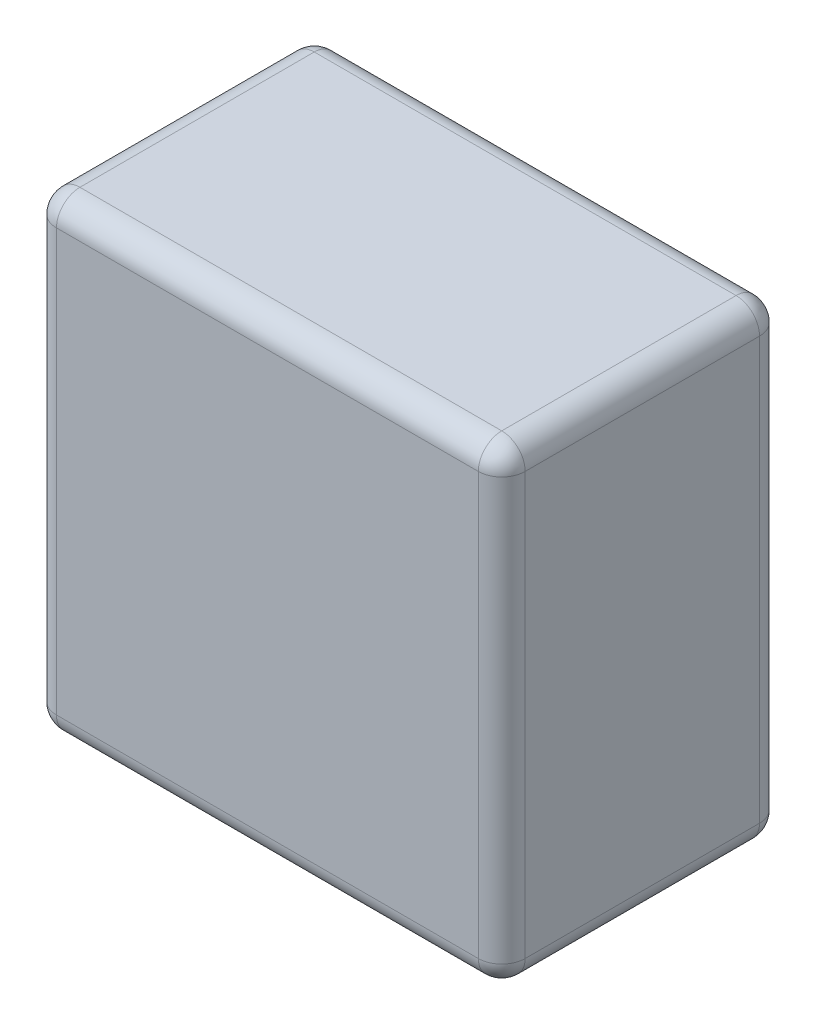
ISO-10303-21;
HEADER;
FILE_DESCRIPTION(('STEP AP214'),'2;1');
FILE_NAME('part.step','',(''),(''),'','','');
FILE_SCHEMA(('AUTOMOTIVE_DESIGN { 1 0 10303 214 1 1 1 1 }'));
ENDSEC;
DATA;
#1=APPLICATION_CONTEXT('core data for automotive mechanical design processes');
#2=APPLICATION_PROTOCOL_DEFINITION('international standard','automotive_design',2000,#1);
#3=PRODUCT_CONTEXT('',#1,'mechanical');
#4=PRODUCT('Part','Part','',(#3));
#5=PRODUCT_RELATED_PRODUCT_CATEGORY('part','',(#4));
#6=PRODUCT_DEFINITION_FORMATION('','',#4);
#7=PRODUCT_DEFINITION_CONTEXT('part definition',#1,'design');
#8=PRODUCT_DEFINITION('design','',#6,#7);
#9=PRODUCT_DEFINITION_SHAPE('','',#8);
#10=(LENGTH_UNIT() NAMED_UNIT(*) SI_UNIT(.MILLI.,.METRE.));
#11=(NAMED_UNIT(*) PLANE_ANGLE_UNIT() SI_UNIT($,.RADIAN.));
#12=(NAMED_UNIT(*) SI_UNIT($,.STERADIAN.) SOLID_ANGLE_UNIT());
#13=UNCERTAINTY_MEASURE_WITH_UNIT(LENGTH_MEASURE(1.E-05),#10,'distance_accuracy_value','');
#14=(GEOMETRIC_REPRESENTATION_CONTEXT(3) GLOBAL_UNCERTAINTY_ASSIGNED_CONTEXT((#13)) GLOBAL_UNIT_ASSIGNED_CONTEXT((#10,
#11,#12)) REPRESENTATION_CONTEXT('',''));
#15=CARTESIAN_POINT('',(0.,0.,0.));
#16=DIRECTION('',(0.,0.,1.));
#17=DIRECTION('',(1.,0.,0.));
#18=AXIS2_PLACEMENT_3D('',#15,#16,#17);
#19=CARTESIAN_POINT('',(30.,10.,12.));
#20=DIRECTION('',(1.,0.,0.));
#21=DIRECTION('',(0.,1.,0.));
#22=AXIS2_PLACEMENT_3D('',#19,#20,#21);
#23=PLANE('',#22);
#24=DIRECTION('',(0.,-1.,0.));
#25=VECTOR('',#24,1.);
#26=CARTESIAN_POINT('',(30.,10.,1.));
#27=LINE('',#26,#25);
#28=CARTESIAN_POINT('',(30.,9.,1.));
#29=VERTEX_POINT('',#28);
#30=CARTESIAN_POINT('',(30.,-9.,1.));
#31=VERTEX_POINT('',#30);
#32=EDGE_CURVE('E193',#29,#31,#27,.T.);
#33=ORIENTED_EDGE('',*,*,#32,.T.);
#34=DIRECTION('',(0.,0.,-1.));
#35=VECTOR('',#34,1.);
#36=CARTESIAN_POINT('',(30.,-9.,12.));
#37=LINE('',#36,#35);
#38=CARTESIAN_POINT('',(30.,-9.,11.));
#39=VERTEX_POINT('',#38);
#40=EDGE_CURVE('E196',#31,#39,#37,.F.);
#41=ORIENTED_EDGE('',*,*,#40,.T.);
#42=DIRECTION('',(0.,-1.,0.));
#43=VECTOR('',#42,1.);
#44=CARTESIAN_POINT('',(30.,10.,11.));
#45=LINE('',#44,#43);
#46=CARTESIAN_POINT('',(30.,9.,11.));
#47=VERTEX_POINT('',#46);
#48=EDGE_CURVE('E191',#39,#47,#45,.F.);
#49=ORIENTED_EDGE('',*,*,#48,.T.);
#50=DIRECTION('',(0.,0.,-1.));
#51=VECTOR('',#50,1.);
#52=CARTESIAN_POINT('',(30.,9.,0.));
#53=LINE('',#52,#51);
#54=EDGE_CURVE('E189',#47,#29,#53,.T.);
#55=ORIENTED_EDGE('',*,*,#54,.T.);
#56=EDGE_LOOP('',(#33,#41,#49,#55));
#57=FACE_BOUND('',#56,.T.);
#58=ADVANCED_FACE('F34',(#57),#23,.F.);
#59=CARTESIAN_POINT('',(30.,-10.,12.));
#60=DIRECTION('',(0.,1.,0.));
#61=DIRECTION('',(0.,0.,1.));
#62=AXIS2_PLACEMENT_3D('',#59,#60,#61);
#63=PLANE('',#62);
#64=DIRECTION('',(1.,0.,0.));
#65=VECTOR('',#64,1.);
#66=CARTESIAN_POINT('',(30.,-10.,1.));
#67=LINE('',#66,#65);
#68=CARTESIAN_POINT('',(31.,-10.,1.));
#69=VERTEX_POINT('',#68);
#70=CARTESIAN_POINT('',(49.,-10.,1.));
#71=VERTEX_POINT('',#70);
#72=EDGE_CURVE('E133',#69,#71,#67,.T.);
#73=ORIENTED_EDGE('',*,*,#72,.T.);
#74=DIRECTION('',(0.,0.,-1.));
#75=VECTOR('',#74,1.);
#76=CARTESIAN_POINT('',(49.,-10.,12.));
#77=LINE('',#76,#75);
#78=CARTESIAN_POINT('',(49.,-10.,11.));
#79=VERTEX_POINT('',#78);
#80=EDGE_CURVE('E129',#71,#79,#77,.F.);
#81=ORIENTED_EDGE('',*,*,#80,.T.);
#82=DIRECTION('',(1.,0.,0.));
#83=VECTOR('',#82,1.);
#84=CARTESIAN_POINT('',(30.,-10.,11.));
#85=LINE('',#84,#83);
#86=CARTESIAN_POINT('',(31.,-10.,11.));
#87=VERTEX_POINT('',#86);
#88=EDGE_CURVE('E121',#79,#87,#85,.F.);
#89=ORIENTED_EDGE('',*,*,#88,.T.);
#90=DIRECTION('',(0.,0.,-1.));
#91=VECTOR('',#90,1.);
#92=CARTESIAN_POINT('',(31.,-10.,12.));
#93=LINE('',#92,#91);
#94=EDGE_CURVE('E126',#87,#69,#93,.T.);
#95=ORIENTED_EDGE('',*,*,#94,.T.);
#96=EDGE_LOOP('',(#73,#81,#89,#95));
#97=FACE_BOUND('',#96,.T.);
#98=ADVANCED_FACE('F124',(#97),#63,.F.);
#99=CARTESIAN_POINT('',(50.,10.,12.));
#100=DIRECTION('',(1.,0.,0.));
#101=DIRECTION('',(0.,0.,-1.));
#102=AXIS2_PLACEMENT_3D('',#99,#100,#101);
#103=PLANE('',#102);
#104=DIRECTION('',(0.,-1.,0.));
#105=VECTOR('',#104,1.);
#106=CARTESIAN_POINT('',(50.,10.,11.));
#107=LINE('',#106,#105);
#108=CARTESIAN_POINT('',(50.,9.,11.));
#109=VERTEX_POINT('',#108);
#110=CARTESIAN_POINT('',(50.,-9.,11.));
#111=VERTEX_POINT('',#110);
#112=EDGE_CURVE('E173',#109,#111,#107,.T.);
#113=ORIENTED_EDGE('',*,*,#112,.T.);
#114=DIRECTION('',(0.,0.,-1.));
#115=VECTOR('',#114,1.);
#116=CARTESIAN_POINT('',(50.,-9.,0.));
#117=LINE('',#116,#115);
#118=CARTESIAN_POINT('',(50.,-9.,1.));
#119=VERTEX_POINT('',#118);
#120=EDGE_CURVE('E178',#111,#119,#117,.T.);
#121=ORIENTED_EDGE('',*,*,#120,.T.);
#122=DIRECTION('',(0.,-1.,0.));
#123=VECTOR('',#122,1.);
#124=CARTESIAN_POINT('',(50.,10.,1.));
#125=LINE('',#124,#123);
#126=CARTESIAN_POINT('',(50.,9.,1.));
#127=VERTEX_POINT('',#126);
#128=EDGE_CURVE('E175',#119,#127,#125,.F.);
#129=ORIENTED_EDGE('',*,*,#128,.T.);
#130=DIRECTION('',(0.,0.,-1.));
#131=VECTOR('',#130,1.);
#132=CARTESIAN_POINT('',(50.,9.,12.));
#133=LINE('',#132,#131);
#134=EDGE_CURVE('E171',#127,#109,#133,.F.);
#135=ORIENTED_EDGE('',*,*,#134,.T.);
#136=EDGE_LOOP('',(#113,#121,#129,#135));
#137=FACE_BOUND('',#136,.T.);
#138=ADVANCED_FACE('F264',(#137),#103,.T.);
#139=CARTESIAN_POINT('',(30.,10.,12.));
#140=DIRECTION('',(0.,1.,0.));
#141=DIRECTION('',(-1.,0.,0.));
#142=AXIS2_PLACEMENT_3D('',#139,#140,#141);
#143=PLANE('',#142);
#144=DIRECTION('',(1.,0.,0.));
#145=VECTOR('',#144,1.);
#146=CARTESIAN_POINT('',(30.,10.,11.));
#147=LINE('',#146,#145);
#148=CARTESIAN_POINT('',(31.,10.,11.));
#149=VERTEX_POINT('',#148);
#150=CARTESIAN_POINT('',(49.,10.,11.));
#151=VERTEX_POINT('',#150);
#152=EDGE_CURVE('E182',#149,#151,#147,.T.);
#153=ORIENTED_EDGE('',*,*,#152,.T.);
#154=DIRECTION('',(0.,0.,-1.));
#155=VECTOR('',#154,1.);
#156=CARTESIAN_POINT('',(49.,10.,12.));
#157=LINE('',#156,#155);
#158=CARTESIAN_POINT('',(49.,10.,1.));
#159=VERTEX_POINT('',#158);
#160=EDGE_CURVE('E187',#151,#159,#157,.T.);
#161=ORIENTED_EDGE('',*,*,#160,.T.);
#162=DIRECTION('',(1.,0.,0.));
#163=VECTOR('',#162,1.);
#164=CARTESIAN_POINT('',(30.,10.,1.));
#165=LINE('',#164,#163);
#166=CARTESIAN_POINT('',(31.,10.,1.));
#167=VERTEX_POINT('',#166);
#168=EDGE_CURVE('E184',#159,#167,#165,.F.);
#169=ORIENTED_EDGE('',*,*,#168,.T.);
#170=DIRECTION('',(0.,0.,-1.));
#171=VECTOR('',#170,1.);
#172=CARTESIAN_POINT('',(31.,10.,12.));
#173=LINE('',#172,#171);
#174=EDGE_CURVE('E180',#167,#149,#173,.F.);
#175=ORIENTED_EDGE('',*,*,#174,.T.);
#176=EDGE_LOOP('',(#153,#161,#169,#175));
#177=FACE_BOUND('',#176,.T.);
#178=ADVANCED_FACE('F273',(#177),#143,.T.);
#179=CARTESIAN_POINT('',(0.,0.,12.));
#180=DIRECTION('',(0.,0.,1.));
#181=DIRECTION('',(1.,0.,0.));
#182=AXIS2_PLACEMENT_3D('',#179,#180,#181);
#183=PLANE('',#182);
#184=DIRECTION('',(0.,-1.,0.));
#185=VECTOR('',#184,1.);
#186=CARTESIAN_POINT('',(49.,0.,12.));
#187=LINE('',#186,#185);
#188=CARTESIAN_POINT('',(49.,-9.,12.));
#189=VERTEX_POINT('',#188);
#190=CARTESIAN_POINT('',(49.,9.,12.));
#191=VERTEX_POINT('',#190);
#192=EDGE_CURVE('E43',#189,#191,#187,.F.);
#193=ORIENTED_EDGE('',*,*,#192,.T.);
#194=DIRECTION('',(1.,0.,0.));
#195=VECTOR('',#194,1.);
#196=CARTESIAN_POINT('',(0.,9.00000000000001,12.));
#197=LINE('',#196,#195);
#198=CARTESIAN_POINT('',(31.,9.,12.));
#199=VERTEX_POINT('',#198);
#200=EDGE_CURVE('E11',#191,#199,#197,.F.);
#201=ORIENTED_EDGE('',*,*,#200,.T.);
#202=DIRECTION('',(0.,-1.,0.));
#203=VECTOR('',#202,1.);
#204=CARTESIAN_POINT('',(31.,-10.,12.));
#205=LINE('',#204,#203);
#206=CARTESIAN_POINT('',(31.,-9.,12.));
#207=VERTEX_POINT('',#206);
#208=EDGE_CURVE('E198',#199,#207,#205,.T.);
#209=ORIENTED_EDGE('',*,*,#208,.T.);
#210=DIRECTION('',(1.,0.,0.));
#211=VECTOR('',#210,1.);
#212=CARTESIAN_POINT('',(50.,-9.,12.));
#213=LINE('',#212,#211);
#214=EDGE_CURVE('E54',#207,#189,#213,.T.);
#215=ORIENTED_EDGE('',*,*,#214,.T.);
#216=EDGE_LOOP('',(#193,#201,#209,#215));
#217=FACE_BOUND('',#216,.T.);
#218=ADVANCED_FACE('F295',(#217),#183,.T.);
#219=CARTESIAN_POINT('',(0.,0.,0.));
#220=DIRECTION('',(0.,0.,1.));
#221=DIRECTION('',(1.,0.,0.));
#222=AXIS2_PLACEMENT_3D('',#219,#220,#221);
#223=PLANE('',#222);
#224=DIRECTION('',(0.,-1.,0.));
#225=VECTOR('',#224,1.);
#226=CARTESIAN_POINT('',(49.,-10.,0.));
#227=LINE('',#226,#225);
#228=CARTESIAN_POINT('',(49.,9.,0.));
#229=VERTEX_POINT('',#228);
#230=CARTESIAN_POINT('',(49.,-9.,0.));
#231=VERTEX_POINT('',#230);
#232=EDGE_CURVE('E166',#229,#231,#227,.T.);
#233=ORIENTED_EDGE('',*,*,#232,.T.);
#234=DIRECTION('',(1.,0.,0.));
#235=VECTOR('',#234,1.);
#236=CARTESIAN_POINT('',(0.,-9.,0.));
#237=LINE('',#236,#235);
#238=CARTESIAN_POINT('',(31.,-9.,0.));
#239=VERTEX_POINT('',#238);
#240=EDGE_CURVE('E168',#231,#239,#237,.F.);
#241=ORIENTED_EDGE('',*,*,#240,.T.);
#242=DIRECTION('',(0.,-1.,0.));
#243=VECTOR('',#242,1.);
#244=CARTESIAN_POINT('',(31.,0.,0.));
#245=LINE('',#244,#243);
#246=CARTESIAN_POINT('',(31.,9.,0.));
#247=VERTEX_POINT('',#246);
#248=EDGE_CURVE('E162',#239,#247,#245,.F.);
#249=ORIENTED_EDGE('',*,*,#248,.T.);
#250=DIRECTION('',(1.,0.,0.));
#251=VECTOR('',#250,1.);
#252=CARTESIAN_POINT('',(50.,9.,0.));
#253=LINE('',#252,#251);
#254=EDGE_CURVE('E164',#247,#229,#253,.T.);
#255=ORIENTED_EDGE('',*,*,#254,.T.);
#256=EDGE_LOOP('',(#233,#241,#249,#255));
#257=FACE_BOUND('',#256,.T.);
#258=ADVANCED_FACE('F297',(#257),#223,.F.);
#259=CARTESIAN_POINT('',(30.,9.,11.));
#260=DIRECTION('',(1.,0.,0.));
#261=DIRECTION('',(0.,1.,0.));
#262=AXIS2_PLACEMENT_3D('',#259,#260,#261);
#263=CYLINDRICAL_SURFACE('',#262,1.);
#264=CARTESIAN_POINT('',(31.,9.,11.));
#265=DIRECTION('',(-1.,0.,0.));
#266=DIRECTION('',(0.,0.,1.));
#267=AXIS2_PLACEMENT_3D('',#264,#265,#266);
#268=CIRCLE('',#267,1.);
#269=EDGE_CURVE('E38',#199,#149,#268,.T.);
#270=ORIENTED_EDGE('',*,*,#269,.F.);
#271=ORIENTED_EDGE('',*,*,#200,.F.);
#272=CARTESIAN_POINT('',(49.,9.,11.));
#273=DIRECTION('',(1.,0.,0.));
#274=DIRECTION('',(0.,0.,-1.));
#275=AXIS2_PLACEMENT_3D('',#272,#273,#274);
#276=CIRCLE('',#275,1.);
#277=EDGE_CURVE('E158',#151,#191,#276,.T.);
#278=ORIENTED_EDGE('',*,*,#277,.F.);
#279=ORIENTED_EDGE('',*,*,#152,.F.);
#280=EDGE_LOOP('',(#270,#271,#278,#279));
#281=FACE_BOUND('',#280,.T.);
#282=ADVANCED_FACE('F36',(#281),#263,.T.);
#283=CARTESIAN_POINT('',(31.,9.,11.));
#284=DIRECTION('',(0.,0.,1.));
#285=DIRECTION('',(1.,0.,0.));
#286=AXIS2_PLACEMENT_3D('',#283,#284,#285);
#287=SPHERICAL_SURFACE('',#286,1.);
#288=CARTESIAN_POINT('',(31.,9.,11.));
#289=DIRECTION('',(0.,1.,0.));
#290=DIRECTION('',(0.,0.,1.));
#291=AXIS2_PLACEMENT_3D('',#288,#289,#290);
#292=CIRCLE('',#291,1.);
#293=EDGE_CURVE('E244',#199,#47,#292,.F.);
#294=ORIENTED_EDGE('',*,*,#293,.F.);
#295=ORIENTED_EDGE('',*,*,#269,.T.);
#296=CARTESIAN_POINT('',(31.,9.,11.));
#297=DIRECTION('',(0.,0.,1.));
#298=DIRECTION('',(1.,0.,0.));
#299=AXIS2_PLACEMENT_3D('',#296,#297,#298);
#300=CIRCLE('',#299,1.);
#301=EDGE_CURVE('E247',#47,#149,#300,.F.);
#302=ORIENTED_EDGE('',*,*,#301,.F.);
#303=EDGE_LOOP('',(#294,#295,#302));
#304=FACE_BOUND('',#303,.T.);
#305=ADVANCED_FACE('F291',(#304),#287,.T.);
#306=CARTESIAN_POINT('',(49.,9.,11.));
#307=DIRECTION('',(0.,0.,1.));
#308=DIRECTION('',(1.,0.,0.));
#309=AXIS2_PLACEMENT_3D('',#306,#307,#308);
#310=SPHERICAL_SURFACE('',#309,1.);
#311=CARTESIAN_POINT('',(49.,9.,11.));
#312=DIRECTION('',(0.,0.,1.));
#313=DIRECTION('',(1.,0.,0.));
#314=AXIS2_PLACEMENT_3D('',#311,#312,#313);
#315=CIRCLE('',#314,1.);
#316=EDGE_CURVE('E238',#151,#109,#315,.F.);
#317=ORIENTED_EDGE('',*,*,#316,.F.);
#318=ORIENTED_EDGE('',*,*,#277,.T.);
#319=CARTESIAN_POINT('',(49.,9.,11.));
#320=DIRECTION('',(0.,1.,0.));
#321=DIRECTION('',(0.,0.,1.));
#322=AXIS2_PLACEMENT_3D('',#319,#320,#321);
#323=CIRCLE('',#322,1.);
#324=EDGE_CURVE('E241',#109,#191,#323,.F.);
#325=ORIENTED_EDGE('',*,*,#324,.F.);
#326=EDGE_LOOP('',(#317,#318,#325));
#327=FACE_BOUND('',#326,.T.);
#328=ADVANCED_FACE('F254',(#327),#310,.T.);
#329=CARTESIAN_POINT('',(31.,9.,12.));
#330=DIRECTION('',(0.,0.,1.));
#331=DIRECTION('',(1.,0.,0.));
#332=AXIS2_PLACEMENT_3D('',#329,#330,#331);
#333=CYLINDRICAL_SURFACE('',#332,1.);
#334=ORIENTED_EDGE('',*,*,#301,.T.);
#335=ORIENTED_EDGE('',*,*,#174,.F.);
#336=CARTESIAN_POINT('',(31.,9.,1.));
#337=DIRECTION('',(0.,0.,-1.));
#338=DIRECTION('',(0.,1.,0.));
#339=AXIS2_PLACEMENT_3D('',#336,#337,#338);
#340=CIRCLE('',#339,1.);
#341=EDGE_CURVE('E233',#29,#167,#340,.T.);
#342=ORIENTED_EDGE('',*,*,#341,.F.);
#343=ORIENTED_EDGE('',*,*,#54,.F.);
#344=EDGE_LOOP('',(#334,#335,#342,#343));
#345=FACE_BOUND('',#344,.T.);
#346=ADVANCED_FACE('F285',(#345),#333,.T.);
#347=CARTESIAN_POINT('',(31.,0.,11.));
#348=DIRECTION('',(0.,1.,0.));
#349=DIRECTION('',(-1.,0.,0.));
#350=AXIS2_PLACEMENT_3D('',#347,#348,#349);
#351=CYLINDRICAL_SURFACE('',#350,1.);
#352=ORIENTED_EDGE('',*,*,#293,.T.);
#353=ORIENTED_EDGE('',*,*,#48,.F.);
#354=CARTESIAN_POINT('',(31.,-9.,11.));
#355=DIRECTION('',(0.,-1.,0.));
#356=DIRECTION('',(0.,0.,-1.));
#357=AXIS2_PLACEMENT_3D('',#354,#355,#356);
#358=CIRCLE('',#357,1.);
#359=EDGE_CURVE('E142',#207,#39,#358,.T.);
#360=ORIENTED_EDGE('',*,*,#359,.F.);
#361=ORIENTED_EDGE('',*,*,#208,.F.);
#362=EDGE_LOOP('',(#352,#353,#360,#361));
#363=FACE_BOUND('',#362,.T.);
#364=ADVANCED_FACE('F294',(#363),#351,.T.);
#365=CARTESIAN_POINT('',(0.,-9.,11.));
#366=DIRECTION('',(-1.,0.,0.));
#367=DIRECTION('',(0.,0.,1.));
#368=AXIS2_PLACEMENT_3D('',#365,#366,#367);
#369=CYLINDRICAL_SURFACE('',#368,1.);
#370=CARTESIAN_POINT('',(49.,-9.,11.));
#371=DIRECTION('',(1.,0.,0.));
#372=DIRECTION('',(0.,0.,-1.));
#373=AXIS2_PLACEMENT_3D('',#370,#371,#372);
#374=CIRCLE('',#373,1.);
#375=EDGE_CURVE('E143',#189,#79,#374,.T.);
#376=ORIENTED_EDGE('',*,*,#375,.F.);
#377=ORIENTED_EDGE('',*,*,#214,.F.);
#378=CARTESIAN_POINT('',(31.,-9.,11.));
#379=DIRECTION('',(-1.,0.,0.));
#380=DIRECTION('',(0.,0.,1.));
#381=AXIS2_PLACEMENT_3D('',#378,#379,#380);
#382=CIRCLE('',#381,1.);
#383=EDGE_CURVE('E136',#87,#207,#382,.T.);
#384=ORIENTED_EDGE('',*,*,#383,.F.);
#385=ORIENTED_EDGE('',*,*,#88,.F.);
#386=EDGE_LOOP('',(#376,#377,#384,#385));
#387=FACE_BOUND('',#386,.T.);
#388=ADVANCED_FACE('F138',(#387),#369,.T.);
#389=CARTESIAN_POINT('',(49.,10.,11.));
#390=DIRECTION('',(0.,-1.,0.));
#391=DIRECTION('',(0.,0.,-1.));
#392=AXIS2_PLACEMENT_3D('',#389,#390,#391);
#393=CYLINDRICAL_SURFACE('',#392,1.);
#394=ORIENTED_EDGE('',*,*,#324,.T.);
#395=ORIENTED_EDGE('',*,*,#192,.F.);
#396=CARTESIAN_POINT('',(49.,-9.,11.));
#397=DIRECTION('',(0.,-1.,0.));
#398=DIRECTION('',(0.,0.,-1.));
#399=AXIS2_PLACEMENT_3D('',#396,#397,#398);
#400=CIRCLE('',#399,1.);
#401=EDGE_CURVE('E228',#111,#189,#400,.T.);
#402=ORIENTED_EDGE('',*,*,#401,.F.);
#403=ORIENTED_EDGE('',*,*,#112,.F.);
#404=EDGE_LOOP('',(#394,#395,#402,#403));
#405=FACE_BOUND('',#404,.T.);
#406=ADVANCED_FACE('F260',(#405),#393,.T.);
#407=CARTESIAN_POINT('',(49.,9.,12.));
#408=DIRECTION('',(0.,0.,-1.));
#409=DIRECTION('',(-1.,0.,0.));
#410=AXIS2_PLACEMENT_3D('',#407,#408,#409);
#411=CYLINDRICAL_SURFACE('',#410,1.);
#412=ORIENTED_EDGE('',*,*,#316,.T.);
#413=ORIENTED_EDGE('',*,*,#134,.F.);
#414=CARTESIAN_POINT('',(49.,9.,1.));
#415=DIRECTION('',(0.,0.,-1.));
#416=DIRECTION('',(-1.,0.,0.));
#417=AXIS2_PLACEMENT_3D('',#414,#415,#416);
#418=CIRCLE('',#417,1.);
#419=EDGE_CURVE('E225',#159,#127,#418,.T.);
#420=ORIENTED_EDGE('',*,*,#419,.F.);
#421=ORIENTED_EDGE('',*,*,#160,.F.);
#422=EDGE_LOOP('',(#412,#413,#420,#421));
#423=FACE_BOUND('',#422,.T.);
#424=ADVANCED_FACE('F270',(#423),#411,.T.);
#425=CARTESIAN_POINT('',(0.,9.00000000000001,1.));
#426=DIRECTION('',(-1.,0.,0.));
#427=DIRECTION('',(0.,-1.,0.));
#428=AXIS2_PLACEMENT_3D('',#425,#426,#427);
#429=CYLINDRICAL_SURFACE('',#428,1.);
#430=CARTESIAN_POINT('',(31.,9.,1.));
#431=DIRECTION('',(-1.,0.,0.));
#432=DIRECTION('',(0.,0.,1.));
#433=AXIS2_PLACEMENT_3D('',#430,#431,#432);
#434=CIRCLE('',#433,1.);
#435=EDGE_CURVE('E235',#167,#247,#434,.T.);
#436=ORIENTED_EDGE('',*,*,#435,.F.);
#437=ORIENTED_EDGE('',*,*,#168,.F.);
#438=CARTESIAN_POINT('',(49.,9.,1.));
#439=DIRECTION('',(1.,0.,0.));
#440=DIRECTION('',(0.,0.,-1.));
#441=AXIS2_PLACEMENT_3D('',#438,#439,#440);
#442=CIRCLE('',#441,1.);
#443=EDGE_CURVE('E222',#229,#159,#442,.T.);
#444=ORIENTED_EDGE('',*,*,#443,.F.);
#445=ORIENTED_EDGE('',*,*,#254,.F.);
#446=EDGE_LOOP('',(#436,#437,#444,#445));
#447=FACE_BOUND('',#446,.T.);
#448=ADVANCED_FACE('F277',(#447),#429,.T.);
#449=CARTESIAN_POINT('',(31.,9.,1.));
#450=DIRECTION('',(0.,0.,1.));
#451=DIRECTION('',(1.,0.,0.));
#452=AXIS2_PLACEMENT_3D('',#449,#450,#451);
#453=SPHERICAL_SURFACE('',#452,1.);
#454=ORIENTED_EDGE('',*,*,#341,.T.);
#455=ORIENTED_EDGE('',*,*,#435,.T.);
#456=CARTESIAN_POINT('',(31.,9.,1.));
#457=DIRECTION('',(0.,1.,0.));
#458=DIRECTION('',(-1.,0.,0.));
#459=AXIS2_PLACEMENT_3D('',#456,#457,#458);
#460=CIRCLE('',#459,1.);
#461=EDGE_CURVE('E150',#29,#247,#460,.F.);
#462=ORIENTED_EDGE('',*,*,#461,.F.);
#463=EDGE_LOOP('',(#454,#455,#462));
#464=FACE_BOUND('',#463,.T.);
#465=ADVANCED_FACE('F351',(#464),#453,.T.);
#466=CARTESIAN_POINT('',(31.,-9.,11.));
#467=DIRECTION('',(0.,0.,1.));
#468=DIRECTION('',(1.,0.,0.));
#469=AXIS2_PLACEMENT_3D('',#466,#467,#468);
#470=SPHERICAL_SURFACE('',#469,1.);
#471=ORIENTED_EDGE('',*,*,#383,.T.);
#472=ORIENTED_EDGE('',*,*,#359,.T.);
#473=CARTESIAN_POINT('',(31.,-9.,11.));
#474=DIRECTION('',(0.,0.,1.));
#475=DIRECTION('',(1.,0.,0.));
#476=AXIS2_PLACEMENT_3D('',#473,#474,#475);
#477=CIRCLE('',#476,1.);
#478=EDGE_CURVE('E146',#87,#39,#477,.F.);
#479=ORIENTED_EDGE('',*,*,#478,.F.);
#480=EDGE_LOOP('',(#471,#472,#479));
#481=FACE_BOUND('',#480,.T.);
#482=ADVANCED_FACE('F147',(#481),#470,.T.);
#483=CARTESIAN_POINT('',(49.,-9.,11.));
#484=DIRECTION('',(0.,0.,1.));
#485=DIRECTION('',(1.,0.,0.));
#486=AXIS2_PLACEMENT_3D('',#483,#484,#485);
#487=SPHERICAL_SURFACE('',#486,1.);
#488=ORIENTED_EDGE('',*,*,#401,.T.);
#489=ORIENTED_EDGE('',*,*,#375,.T.);
#490=CARTESIAN_POINT('',(49.,-9.,11.));
#491=DIRECTION('',(0.,0.,1.));
#492=DIRECTION('',(1.,0.,0.));
#493=AXIS2_PLACEMENT_3D('',#490,#491,#492);
#494=CIRCLE('',#493,1.);
#495=EDGE_CURVE('E151',#111,#79,#494,.F.);
#496=ORIENTED_EDGE('',*,*,#495,.F.);
#497=EDGE_LOOP('',(#488,#489,#496));
#498=FACE_BOUND('',#497,.T.);
#499=ADVANCED_FACE('F344',(#498),#487,.T.);
#500=CARTESIAN_POINT('',(49.,9.,1.));
#501=DIRECTION('',(0.,0.,1.));
#502=DIRECTION('',(1.,0.,0.));
#503=AXIS2_PLACEMENT_3D('',#500,#501,#502);
#504=SPHERICAL_SURFACE('',#503,1.);
#505=ORIENTED_EDGE('',*,*,#443,.T.);
#506=ORIENTED_EDGE('',*,*,#419,.T.);
#507=CARTESIAN_POINT('',(49.,9.,1.));
#508=DIRECTION('',(0.,1.,0.));
#509=DIRECTION('',(0.,0.,1.));
#510=AXIS2_PLACEMENT_3D('',#507,#508,#509);
#511=CIRCLE('',#510,1.);
#512=EDGE_CURVE('E216',#229,#127,#511,.F.);
#513=ORIENTED_EDGE('',*,*,#512,.F.);
#514=EDGE_LOOP('',(#505,#506,#513));
#515=FACE_BOUND('',#514,.T.);
#516=ADVANCED_FACE('F340',(#515),#504,.T.);
#517=CARTESIAN_POINT('',(31.,10.,1.));
#518=DIRECTION('',(0.,-1.,0.));
#519=DIRECTION('',(1.,0.,0.));
#520=AXIS2_PLACEMENT_3D('',#517,#518,#519);
#521=CYLINDRICAL_SURFACE('',#520,1.);
#522=ORIENTED_EDGE('',*,*,#461,.T.);
#523=ORIENTED_EDGE('',*,*,#248,.F.);
#524=CARTESIAN_POINT('',(31.,-9.,1.));
#525=DIRECTION('',(0.,-1.,0.));
#526=DIRECTION('',(0.,0.,-1.));
#527=AXIS2_PLACEMENT_3D('',#524,#525,#526);
#528=CIRCLE('',#527,1.);
#529=EDGE_CURVE('E213',#31,#239,#528,.T.);
#530=ORIENTED_EDGE('',*,*,#529,.F.);
#531=ORIENTED_EDGE('',*,*,#32,.F.);
#532=EDGE_LOOP('',(#522,#523,#530,#531));
#533=FACE_BOUND('',#532,.T.);
#534=ADVANCED_FACE('F337',(#533),#521,.T.);
#535=CARTESIAN_POINT('',(31.,-9.,12.));
#536=DIRECTION('',(0.,0.,-1.));
#537=DIRECTION('',(-1.,0.,0.));
#538=AXIS2_PLACEMENT_3D('',#535,#536,#537);
#539=CYLINDRICAL_SURFACE('',#538,1.);
#540=ORIENTED_EDGE('',*,*,#478,.T.);
#541=ORIENTED_EDGE('',*,*,#40,.F.);
#542=CARTESIAN_POINT('',(31.,-9.,1.));
#543=DIRECTION('',(0.,0.,-1.));
#544=DIRECTION('',(-1.,0.,0.));
#545=AXIS2_PLACEMENT_3D('',#542,#543,#544);
#546=CIRCLE('',#545,1.);
#547=EDGE_CURVE('E154',#69,#31,#546,.T.);
#548=ORIENTED_EDGE('',*,*,#547,.F.);
#549=ORIENTED_EDGE('',*,*,#94,.F.);
#550=EDGE_LOOP('',(#540,#541,#548,#549));
#551=FACE_BOUND('',#550,.T.);
#552=ADVANCED_FACE('F153',(#551),#539,.T.);
#553=CARTESIAN_POINT('',(49.,-9.,12.));
#554=DIRECTION('',(0.,0.,1.));
#555=DIRECTION('',(1.,0.,0.));
#556=AXIS2_PLACEMENT_3D('',#553,#554,#555);
#557=CYLINDRICAL_SURFACE('',#556,1.);
#558=ORIENTED_EDGE('',*,*,#495,.T.);
#559=ORIENTED_EDGE('',*,*,#80,.F.);
#560=CARTESIAN_POINT('',(49.,-9.,1.));
#561=DIRECTION('',(0.,0.,-1.));
#562=DIRECTION('',(0.,1.,0.));
#563=AXIS2_PLACEMENT_3D('',#560,#561,#562);
#564=CIRCLE('',#563,1.);
#565=EDGE_CURVE('E209',#119,#71,#564,.T.);
#566=ORIENTED_EDGE('',*,*,#565,.F.);
#567=ORIENTED_EDGE('',*,*,#120,.F.);
#568=EDGE_LOOP('',(#558,#559,#566,#567));
#569=FACE_BOUND('',#568,.T.);
#570=ADVANCED_FACE('F330',(#569),#557,.T.);
#571=CARTESIAN_POINT('',(49.,0.,1.));
#572=DIRECTION('',(0.,1.,0.));
#573=DIRECTION('',(0.,0.,1.));
#574=AXIS2_PLACEMENT_3D('',#571,#572,#573);
#575=CYLINDRICAL_SURFACE('',#574,1.);
#576=ORIENTED_EDGE('',*,*,#512,.T.);
#577=ORIENTED_EDGE('',*,*,#128,.F.);
#578=CARTESIAN_POINT('',(49.,-9.,1.));
#579=DIRECTION('',(0.,-1.,0.));
#580=DIRECTION('',(1.,0.,0.));
#581=AXIS2_PLACEMENT_3D('',#578,#579,#580);
#582=CIRCLE('',#581,1.);
#583=EDGE_CURVE('E206',#231,#119,#582,.T.);
#584=ORIENTED_EDGE('',*,*,#583,.F.);
#585=ORIENTED_EDGE('',*,*,#232,.F.);
#586=EDGE_LOOP('',(#576,#577,#584,#585));
#587=FACE_BOUND('',#586,.T.);
#588=ADVANCED_FACE('F326',(#587),#575,.T.);
#589=CARTESIAN_POINT('',(31.,-9.,1.));
#590=DIRECTION('',(0.,0.,1.));
#591=DIRECTION('',(1.,0.,0.));
#592=AXIS2_PLACEMENT_3D('',#589,#590,#591);
#593=SPHERICAL_SURFACE('',#592,1.);
#594=ORIENTED_EDGE('',*,*,#547,.T.);
#595=ORIENTED_EDGE('',*,*,#529,.T.);
#596=CARTESIAN_POINT('',(31.,-9.,1.));
#597=DIRECTION('',(-1.,0.,0.));
#598=DIRECTION('',(0.,0.,1.));
#599=AXIS2_PLACEMENT_3D('',#596,#597,#598);
#600=CIRCLE('',#599,1.);
#601=EDGE_CURVE('E204',#69,#239,#600,.F.);
#602=ORIENTED_EDGE('',*,*,#601,.F.);
#603=EDGE_LOOP('',(#594,#595,#602));
#604=FACE_BOUND('',#603,.T.);
#605=ADVANCED_FACE('F322',(#604),#593,.T.);
#606=CARTESIAN_POINT('',(49.,-9.,1.));
#607=DIRECTION('',(0.,0.,1.));
#608=DIRECTION('',(1.,0.,0.));
#609=AXIS2_PLACEMENT_3D('',#606,#607,#608);
#610=SPHERICAL_SURFACE('',#609,1.);
#611=ORIENTED_EDGE('',*,*,#583,.T.);
#612=ORIENTED_EDGE('',*,*,#565,.T.);
#613=CARTESIAN_POINT('',(49.,-9.,1.));
#614=DIRECTION('',(1.,0.,0.));
#615=DIRECTION('',(0.,0.,-1.));
#616=AXIS2_PLACEMENT_3D('',#613,#614,#615);
#617=CIRCLE('',#616,1.);
#618=EDGE_CURVE('E202',#231,#71,#617,.F.);
#619=ORIENTED_EDGE('',*,*,#618,.F.);
#620=EDGE_LOOP('',(#611,#612,#619));
#621=FACE_BOUND('',#620,.T.);
#622=ADVANCED_FACE('F318',(#621),#610,.T.);
#623=CARTESIAN_POINT('',(30.,-9.,1.));
#624=DIRECTION('',(1.,0.,0.));
#625=DIRECTION('',(0.,0.,-1.));
#626=AXIS2_PLACEMENT_3D('',#623,#624,#625);
#627=CYLINDRICAL_SURFACE('',#626,1.);
#628=ORIENTED_EDGE('',*,*,#601,.T.);
#629=ORIENTED_EDGE('',*,*,#240,.F.);
#630=ORIENTED_EDGE('',*,*,#618,.T.);
#631=ORIENTED_EDGE('',*,*,#72,.F.);
#632=EDGE_LOOP('',(#628,#629,#630,#631));
#633=FACE_BOUND('',#632,.T.);
#634=ADVANCED_FACE('F315',(#633),#627,.T.);
#635=CLOSED_SHELL('',(#58,#98,#138,#178,#218,#258,#282,#305,#328,#346,#364,#388,#406,#424,#448,
#465,#482,#499,#516,#534,#552,#570,#588,#605,#622,#634));
#636=MANIFOLD_SOLID_BREP('B2',#635);
#637=ADVANCED_BREP_SHAPE_REPRESENTATION('',(#18,#636),#14);
#638=SHAPE_DEFINITION_REPRESENTATION(#9,#637);
ENDSEC;
END-ISO-10303-21;
